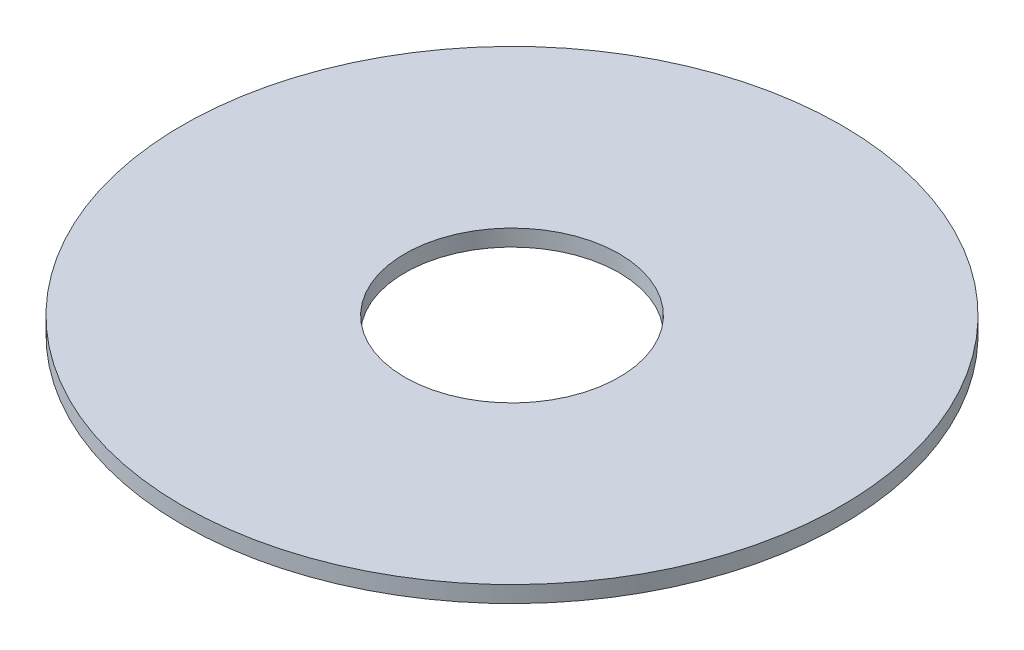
from build123d import *

# Parameters (mm, degrees)
SKETCH1_R           = 5.08
BOSS_EXTRUDE1_DEPTH = 0.254
SKETCH2_R           = 1.651
CUT_EXTRUDE1_DEPTH  = 8.188693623


with BuildPart() as part:
    # Sketch1 → Boss-Extrude1 (new body)
    with BuildSketch(Plane(origin=(0, 0, 0), x_dir=(1, 0, 0), z_dir=(0, 1, 0))):
        with Locations(Location((0, 0, 0), (0, 0, 270))):
            Circle(SKETCH1_R)
    extrude(amount=BOSS_EXTRUDE1_DEPTH)

    # Sketch2 → Cut-Extrude1 (cut, through all)
    with BuildSketch(Plane(origin=(0, 0.254, 0), x_dir=(1, 0, 0), z_dir=(0, 1, 0))):
        with Locations(Location((0, 0, 0), (0, 0, 270))):
            Circle(SKETCH2_R)
    extrude(amount=-CUT_EXTRUDE1_DEPTH, mode=Mode.SUBTRACT)


solid = part.part
